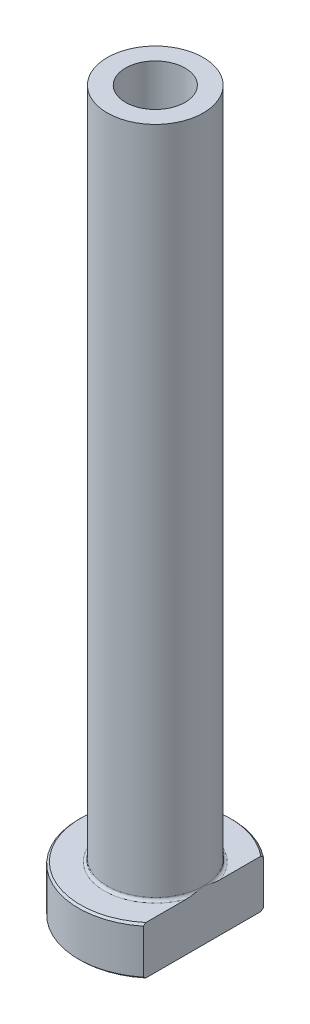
ISO-10303-21;
HEADER;
FILE_DESCRIPTION(('STEP AP214'),'2;1');
FILE_NAME('part.step','',(''),(''),'','','');
FILE_SCHEMA(('AUTOMOTIVE_DESIGN { 1 0 10303 214 1 1 1 1 }'));
ENDSEC;
DATA;
#1=APPLICATION_CONTEXT('core data for automotive mechanical design processes');
#2=APPLICATION_PROTOCOL_DEFINITION('international standard','automotive_design',2000,#1);
#3=PRODUCT_CONTEXT('',#1,'mechanical');
#4=PRODUCT('Part','Part','',(#3));
#5=PRODUCT_RELATED_PRODUCT_CATEGORY('part','',(#4));
#6=PRODUCT_DEFINITION_FORMATION('','',#4);
#7=PRODUCT_DEFINITION_CONTEXT('part definition',#1,'design');
#8=PRODUCT_DEFINITION('design','',#6,#7);
#9=PRODUCT_DEFINITION_SHAPE('','',#8);
#10=(LENGTH_UNIT() NAMED_UNIT(*) SI_UNIT(.MILLI.,.METRE.));
#11=(NAMED_UNIT(*) PLANE_ANGLE_UNIT() SI_UNIT($,.RADIAN.));
#12=(NAMED_UNIT(*) SI_UNIT($,.STERADIAN.) SOLID_ANGLE_UNIT());
#13=UNCERTAINTY_MEASURE_WITH_UNIT(LENGTH_MEASURE(1.E-05),#10,'distance_accuracy_value','');
#14=(GEOMETRIC_REPRESENTATION_CONTEXT(3) GLOBAL_UNCERTAINTY_ASSIGNED_CONTEXT((#13)) GLOBAL_UNIT_ASSIGNED_CONTEXT((#10,
#11,#12)) REPRESENTATION_CONTEXT('',''));
#15=CARTESIAN_POINT('',(0.,0.,0.));
#16=DIRECTION('',(0.,0.,1.));
#17=DIRECTION('',(1.,0.,0.));
#18=AXIS2_PLACEMENT_3D('',#15,#16,#17);
#19=CARTESIAN_POINT('',(0.,92.1876809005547,0.));
#20=DIRECTION('',(0.,1.,0.));
#21=DIRECTION('',(0.,0.,1.));
#22=AXIS2_PLACEMENT_3D('',#19,#20,#21);
#23=CYLINDRICAL_SURFACE('',#22,3.10000000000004);
#24=CARTESIAN_POINT('',(0.,75.,0.));
#25=DIRECTION('',(0.,1.,0.));
#26=DIRECTION('',(0.,0.,1.));
#27=AXIS2_PLACEMENT_3D('',#24,#25,#26);
#28=CIRCLE('',#27,3.10000000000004);
#29=CARTESIAN_POINT('',(0.,75.,3.10000000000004));
#30=VERTEX_POINT('',#29);
#31=EDGE_CURVE('E167',#30,#30,#28,.T.);
#32=ORIENTED_EDGE('',*,*,#31,.T.);
#33=EDGE_LOOP('',(#32));
#34=FACE_BOUND('',#33,.T.);
#35=CARTESIAN_POINT('',(0.,30.,0.));
#36=DIRECTION('',(0.,1.,0.));
#37=DIRECTION('',(0.,0.,1.));
#38=AXIS2_PLACEMENT_3D('',#35,#36,#37);
#39=CIRCLE('',#38,3.10000000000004);
#40=CARTESIAN_POINT('',(0.,30.,3.10000000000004));
#41=VERTEX_POINT('',#40);
#42=EDGE_CURVE('E170',#41,#41,#39,.T.);
#43=ORIENTED_EDGE('',*,*,#42,.F.);
#44=EDGE_LOOP('',(#43));
#45=FACE_BOUND('',#44,.T.);
#46=ADVANCED_FACE('F32',(#34,#45),#23,.F.);
#47=CARTESIAN_POINT('',(-3.10000000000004,75.,0.));
#48=DIRECTION('',(0.,1.,0.));
#49=DIRECTION('',(0.,0.,1.));
#50=AXIS2_PLACEMENT_3D('',#47,#48,#49);
#51=PLANE('',#50);
#52=CARTESIAN_POINT('',(0.,75.,0.));
#53=DIRECTION('',(0.,1.,0.));
#54=DIRECTION('',(0.,0.,1.));
#55=AXIS2_PLACEMENT_3D('',#52,#53,#54);
#56=CIRCLE('',#55,5.);
#57=CARTESIAN_POINT('',(0.,75.,5.));
#58=VERTEX_POINT('',#57);
#59=EDGE_CURVE('E174',#58,#58,#56,.T.);
#60=ORIENTED_EDGE('',*,*,#59,.T.);
#61=EDGE_LOOP('',(#60));
#62=FACE_BOUND('',#61,.T.);
#63=ORIENTED_EDGE('',*,*,#31,.F.);
#64=EDGE_LOOP('',(#63));
#65=FACE_BOUND('',#64,.T.);
#66=ADVANCED_FACE('F157',(#62,#65),#51,.T.);
#67=CARTESIAN_POINT('',(0.,92.1876809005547,0.));
#68=DIRECTION('',(0.,1.,0.));
#69=DIRECTION('',(0.,0.,1.));
#70=AXIS2_PLACEMENT_3D('',#67,#68,#69);
#71=CYLINDRICAL_SURFACE('',#70,4.99999999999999);
#72=CARTESIAN_POINT('',(0.,5.3,0.));
#73=DIRECTION('',(0.,1.,0.));
#74=DIRECTION('',(0.,0.,1.));
#75=AXIS2_PLACEMENT_3D('',#72,#73,#74);
#76=CIRCLE('',#75,4.99999999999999);
#77=CARTESIAN_POINT('',(4.99999999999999,5.3,0.));
#78=VERTEX_POINT('',#77);
#79=EDGE_CURVE('E180',#78,#78,#76,.T.);
#80=ORIENTED_EDGE('',*,*,#79,.T.);
#81=EDGE_LOOP('',(#80));
#82=FACE_BOUND('',#81,.T.);
#83=ORIENTED_EDGE('',*,*,#59,.F.);
#84=EDGE_LOOP('',(#83));
#85=FACE_BOUND('',#84,.T.);
#86=ADVANCED_FACE('F162',(#82,#85),#71,.T.);
#87=CARTESIAN_POINT('',(-4.99999999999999,5.,0.));
#88=DIRECTION('',(0.,1.,0.));
#89=DIRECTION('',(0.,0.,1.));
#90=AXIS2_PLACEMENT_3D('',#87,#88,#89);
#91=PLANE('',#90);
#92=DIRECTION('',(0.,0.,1.));
#93=VECTOR('',#92,1.);
#94=CARTESIAN_POINT('',(5.,5.,0.));
#95=LINE('',#94,#93);
#96=CARTESIAN_POINT('',(5.,5.,-5.98665181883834));
#97=VERTEX_POINT('',#96);
#98=CARTESIAN_POINT('',(5.,5.,-1.75783958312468));
#99=VERTEX_POINT('',#98);
#100=EDGE_CURVE('E54',#97,#99,#95,.T.);
#101=ORIENTED_EDGE('',*,*,#100,.F.);
#102=CARTESIAN_POINT('',(0.,5.,0.));
#103=DIRECTION('',(0.,1.,0.));
#104=DIRECTION('',(0.,0.,1.));
#105=AXIS2_PLACEMENT_3D('',#102,#103,#104);
#106=CIRCLE('',#105,7.80000000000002);
#107=CARTESIAN_POINT('',(4.99999999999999,5.,5.98665181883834));
#108=VERTEX_POINT('',#107);
#109=EDGE_CURVE('E186',#97,#108,#106,.T.);
#110=ORIENTED_EDGE('',*,*,#109,.T.);
#111=CARTESIAN_POINT('',(5.,5.,1.75783958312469));
#112=VERTEX_POINT('',#111);
#113=EDGE_CURVE('E134',#112,#108,#95,.T.);
#114=ORIENTED_EDGE('',*,*,#113,.F.);
#115=CARTESIAN_POINT('',(0.,5.,0.));
#116=DIRECTION('',(0.,1.,0.));
#117=DIRECTION('',(0.,0.,1.));
#118=AXIS2_PLACEMENT_3D('',#115,#116,#117);
#119=CIRCLE('',#118,5.29999999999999);
#120=EDGE_CURVE('E183',#112,#99,#119,.F.);
#121=ORIENTED_EDGE('',*,*,#120,.T.);
#122=EDGE_LOOP('',(#101,#110,#114,#121));
#123=FACE_BOUND('',#122,.T.);
#124=ADVANCED_FACE('F197',(#123),#91,.T.);
#125=CARTESIAN_POINT('',(0.,92.1876809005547,0.));
#126=DIRECTION('',(0.,1.,0.));
#127=DIRECTION('',(0.,0.,1.));
#128=AXIS2_PLACEMENT_3D('',#125,#126,#127);
#129=CYLINDRICAL_SURFACE('',#128,7.99999999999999);
#130=DIRECTION('',(0.,-1.,0.));
#131=VECTOR('',#130,1.);
#132=CARTESIAN_POINT('',(4.99999999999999,75.,6.24499799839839));
#133=LINE('',#132,#131);
#134=CARTESIAN_POINT('',(4.99999999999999,4.80000000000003,6.24499799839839));
#135=VERTEX_POINT('',#134);
#136=CARTESIAN_POINT('',(4.99999999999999,0.199999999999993,6.24499799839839));
#137=VERTEX_POINT('',#136);
#138=EDGE_CURVE('E82',#135,#137,#133,.T.);
#139=ORIENTED_EDGE('',*,*,#138,.F.);
#140=CARTESIAN_POINT('',(0.,4.80000000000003,0.));
#141=DIRECTION('',(0.,1.,0.));
#142=DIRECTION('',(0.,0.,1.));
#143=AXIS2_PLACEMENT_3D('',#140,#141,#142);
#144=CIRCLE('',#143,7.99999999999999);
#145=CARTESIAN_POINT('',(5.,4.80000000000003,-6.24499799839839));
#146=VERTEX_POINT('',#145);
#147=EDGE_CURVE('E95',#135,#146,#144,.F.);
#148=ORIENTED_EDGE('',*,*,#147,.T.);
#149=DIRECTION('',(0.,-1.,0.));
#150=VECTOR('',#149,1.);
#151=CARTESIAN_POINT('',(5.,75.,-6.24499799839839));
#152=LINE('',#151,#150);
#153=CARTESIAN_POINT('',(5.,0.199999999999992,-6.24499799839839));
#154=VERTEX_POINT('',#153);
#155=EDGE_CURVE('E192',#146,#154,#152,.T.);
#156=ORIENTED_EDGE('',*,*,#155,.T.);
#157=CARTESIAN_POINT('',(0.,0.199999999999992,0.));
#158=DIRECTION('',(0.,-1.,0.));
#159=DIRECTION('',(0.,0.,-1.));
#160=AXIS2_PLACEMENT_3D('',#157,#158,#159);
#161=CIRCLE('',#160,7.99999999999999);
#162=EDGE_CURVE('E98',#154,#137,#161,.F.);
#163=ORIENTED_EDGE('',*,*,#162,.T.);
#164=EDGE_LOOP('',(#139,#148,#156,#163));
#165=FACE_BOUND('',#164,.T.);
#166=ADVANCED_FACE('F190',(#165),#129,.T.);
#167=CARTESIAN_POINT('',(-7.99999999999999,0.,0.));
#168=DIRECTION('',(0.,-1.,0.));
#169=DIRECTION('',(0.,0.,-1.));
#170=AXIS2_PLACEMENT_3D('',#167,#168,#169);
#171=PLANE('',#170);
#172=CARTESIAN_POINT('',(0.,0.,0.));
#173=DIRECTION('',(0.,-1.,0.));
#174=DIRECTION('',(0.,0.,-1.));
#175=AXIS2_PLACEMENT_3D('',#172,#173,#174);
#176=CIRCLE('',#175,3.84999999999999);
#177=CARTESIAN_POINT('',(0.,0.,-3.84999999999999));
#178=VERTEX_POINT('',#177);
#179=EDGE_CURVE('E40',#178,#178,#176,.F.);
#180=ORIENTED_EDGE('',*,*,#179,.T.);
#181=EDGE_LOOP('',(#180));
#182=FACE_BOUND('',#181,.T.);
#183=DIRECTION('',(0.,0.,-1.));
#184=VECTOR('',#183,1.);
#185=CARTESIAN_POINT('',(4.99999999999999,0.,6.24499799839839));
#186=LINE('',#185,#184);
#187=CARTESIAN_POINT('',(4.99999999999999,0.,5.98665181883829));
#188=VERTEX_POINT('',#187);
#189=CARTESIAN_POINT('',(5.,0.,-5.98665181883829));
#190=VERTEX_POINT('',#189);
#191=EDGE_CURVE('E47',#188,#190,#186,.T.);
#192=ORIENTED_EDGE('',*,*,#191,.F.);
#193=CARTESIAN_POINT('',(0.,0.,0.));
#194=DIRECTION('',(0.,-1.,0.));
#195=DIRECTION('',(0.,0.,-1.));
#196=AXIS2_PLACEMENT_3D('',#193,#194,#195);
#197=CIRCLE('',#196,7.79999999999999);
#198=EDGE_CURVE('E92',#188,#190,#197,.T.);
#199=ORIENTED_EDGE('',*,*,#198,.T.);
#200=EDGE_LOOP('',(#192,#199));
#201=FACE_BOUND('',#200,.T.);
#202=ADVANCED_FACE('F91',(#182,#201),#171,.T.);
#203=CARTESIAN_POINT('',(0.,92.1876809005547,0.));
#204=DIRECTION('',(0.,1.,0.));
#205=DIRECTION('',(0.,0.,1.));
#206=AXIS2_PLACEMENT_3D('',#203,#204,#205);
#207=CYLINDRICAL_SURFACE('',#206,3.34999999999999);
#208=CARTESIAN_POINT('',(0.,0.5,0.));
#209=DIRECTION('',(0.,-1.,0.));
#210=DIRECTION('',(0.,0.,-1.));
#211=AXIS2_PLACEMENT_3D('',#208,#209,#210);
#212=CIRCLE('',#211,3.34999999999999);
#213=CARTESIAN_POINT('',(0.,0.5,-3.34999999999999));
#214=VERTEX_POINT('',#213);
#215=EDGE_CURVE('E11',#214,#214,#212,.T.);
#216=ORIENTED_EDGE('',*,*,#215,.T.);
#217=EDGE_LOOP('',(#216));
#218=FACE_BOUND('',#217,.T.);
#219=CARTESIAN_POINT('',(0.,18.,0.));
#220=DIRECTION('',(0.,1.,0.));
#221=DIRECTION('',(0.,0.,1.));
#222=AXIS2_PLACEMENT_3D('',#219,#220,#221);
#223=CIRCLE('',#222,3.34999999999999);
#224=CARTESIAN_POINT('',(0.,18.,3.34999999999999));
#225=VERTEX_POINT('',#224);
#226=EDGE_CURVE('E172',#225,#225,#223,.T.);
#227=ORIENTED_EDGE('',*,*,#226,.T.);
#228=EDGE_LOOP('',(#227));
#229=FACE_BOUND('',#228,.T.);
#230=ADVANCED_FACE('F215',(#218,#229),#207,.F.);
#231=CARTESIAN_POINT('',(0.,18.,0.));
#232=DIRECTION('',(0.,-1.,0.));
#233=DIRECTION('',(0.,0.,-1.));
#234=AXIS2_PLACEMENT_3D('',#231,#232,#233);
#235=CONICAL_SURFACE('',#234,3.34999999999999,0.0208303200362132);
#236=ORIENTED_EDGE('',*,*,#42,.T.);
#237=EDGE_LOOP('',(#236));
#238=FACE_BOUND('',#237,.T.);
#239=ORIENTED_EDGE('',*,*,#226,.F.);
#240=EDGE_LOOP('',(#239));
#241=FACE_BOUND('',#240,.T.);
#242=ADVANCED_FACE('F111',(#238,#241),#235,.F.);
#243=CARTESIAN_POINT('',(0.,5.3,0.));
#244=DIRECTION('',(0.,1.,0.));
#245=DIRECTION('',(0.,0.,1.));
#246=AXIS2_PLACEMENT_3D('',#243,#244,#245);
#247=TOROIDAL_SURFACE('',#246,5.29999999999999,0.3);
#248=ORIENTED_EDGE('',*,*,#120,.F.);
#249=CARTESIAN_POINT('',(4.99999999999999,5.3,0.));
#250=CARTESIAN_POINT('',(4.99999999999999,5.30000062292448,-1.31469232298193E-10));
#251=CARTESIAN_POINT('',(5.,5.30000124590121,2.52759193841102E-07));
#252=CARTESIAN_POINT('',(5.,5.30000240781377,9.47164293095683E-07));
#253=CARTESIAN_POINT('',(5.,5.30000293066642,1.4059403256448E-06));
#254=CARTESIAN_POINT('',(5.,5.30000402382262,2.50637598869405E-06));
#255=CARTESIAN_POINT('',(5.,5.3000045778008,3.16588898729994E-06));
#256=CARTESIAN_POINT('',(5.,5.3000055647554,4.52859954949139E-06));
#257=CARTESIAN_POINT('',(5.,5.30000600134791,5.22939438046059E-06));
#258=CARTESIAN_POINT('',(5.,5.30000763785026,7.96121967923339E-06));
#259=CARTESIAN_POINT('',(5.,5.30000875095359,1.00477407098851E-05));
#260=CARTESIAN_POINT('',(5.,5.30001056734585,1.41660871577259E-05));
#261=CARTESIAN_POINT('',(5.,5.30001129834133,1.61861781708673E-05));
#262=CARTESIAN_POINT('',(5.,5.30001439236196,2.47865737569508E-05));
#263=CARTESIAN_POINT('',(5.,5.30001672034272,3.13830278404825E-05));
#264=CARTESIAN_POINT('',(5.,5.30002012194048,4.38084214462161E-05));
#265=CARTESIAN_POINT('',(5.,5.30002133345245,4.95992733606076E-05));
#266=CARTESIAN_POINT('',(5.,5.30003020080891,9.27862605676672E-05));
#267=CARTESIAN_POINT('',(5.,5.30003696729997,0.000130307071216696));
#268=CARTESIAN_POINT('',(5.,5.30006659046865,0.000278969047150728));
#269=CARTESIAN_POINT('',(5.,5.30009481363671,0.000389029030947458));
#270=CARTESIAN_POINT('',(5.,5.30020506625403,0.000826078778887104));
#271=CARTESIAN_POINT('',(5.,5.30028365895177,0.00115365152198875));
#272=CARTESIAN_POINT('',(5.,5.30059919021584,0.00245925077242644));
#273=CARTESIAN_POINT('',(5.,5.3008404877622,0.00343651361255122));
#274=CARTESIAN_POINT('',(5.,5.3018462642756,0.00752058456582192));
#275=CARTESIAN_POINT('',(5.,5.3026052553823,0.0106283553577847));
#276=CARTESIAN_POINT('',(5.,5.30996461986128,0.0407482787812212));
#277=CARTESIAN_POINT('',(5.,5.31658985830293,0.0677561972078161));
#278=CARTESIAN_POINT('',(5.,5.32953319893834,0.120688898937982));
#279=CARTESIAN_POINT('',(5.,5.33585289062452,0.146613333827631));
#280=CARTESIAN_POINT('',(5.,5.34926050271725,0.201795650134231));
#281=CARTESIAN_POINT('',(5.,5.35634306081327,0.231054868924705));
#282=CARTESIAN_POINT('',(5.,5.37050252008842,0.28991773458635));
#283=CARTESIAN_POINT('',(5.,5.37757848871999,0.319521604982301));
#284=CARTESIAN_POINT('',(5.,5.39452602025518,0.39103205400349));
#285=CARTESIAN_POINT('',(5.,5.40434071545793,0.4329521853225));
#286=CARTESIAN_POINT('',(5.,5.42340141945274,0.515763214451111));
#287=CARTESIAN_POINT('',(5.,5.43265559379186,0.556652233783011));
#288=CARTESIAN_POINT('',(5.,5.45710553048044,0.667075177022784));
#289=CARTESIAN_POINT('',(5.,5.47194176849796,0.736689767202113));
#290=CARTESIAN_POINT('',(5.,5.50018229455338,0.876836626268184));
#291=CARTESIAN_POINT('',(5.,5.51357312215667,0.947371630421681));
#292=CARTESIAN_POINT('',(5.,5.53930921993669,1.09497328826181));
#293=CARTESIAN_POINT('',(5.,5.55146217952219,1.17207432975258));
#294=CARTESIAN_POINT('',(5.,5.5723966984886,1.32672649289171));
#295=CARTESIAN_POINT('',(5.,5.58117877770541,1.40427754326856));
#296=CARTESIAN_POINT('',(5.,5.59499725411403,1.56873827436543));
#297=CARTESIAN_POINT('',(5.,5.59948802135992,1.65570044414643));
#298=CARTESIAN_POINT('',(5.,5.60018885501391,1.78535304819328));
#299=CARTESIAN_POINT('',(5.,5.59945214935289,1.82802575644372));
#300=CARTESIAN_POINT('',(5.,5.59559364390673,1.91325081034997));
#301=CARTESIAN_POINT('',(5.,5.59247319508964,1.95580321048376));
#302=CARTESIAN_POINT('',(5.,5.58383242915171,2.03512365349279));
#303=CARTESIAN_POINT('',(5.,5.57867386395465,2.07192937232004));
#304=CARTESIAN_POINT('',(5.,5.56543793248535,2.14526756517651));
#305=CARTESIAN_POINT('',(5.,5.55734203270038,2.18179676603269));
#306=CARTESIAN_POINT('',(5.,5.53718005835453,2.25427226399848));
#307=CARTESIAN_POINT('',(5.,5.52507057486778,2.29020746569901));
#308=CARTESIAN_POINT('',(5.,5.5027092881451,2.3422302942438));
#309=CARTESIAN_POINT('',(5.,5.49457811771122,2.3592231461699));
#310=CARTESIAN_POINT('',(5.,5.47657809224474,2.39224900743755));
#311=CARTESIAN_POINT('',(5.,5.4667128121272,2.40828390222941));
#312=CARTESIAN_POINT('',(5.,5.44695893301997,2.43579467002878));
#313=CARTESIAN_POINT('',(5.,5.43745879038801,2.4475459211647));
#314=CARTESIAN_POINT('',(5.,5.41677914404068,2.46946476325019));
#315=CARTESIAN_POINT('',(5.,5.4056054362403,2.47963758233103));
#316=CARTESIAN_POINT('',(5.,5.38617750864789,2.49393642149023));
#317=CARTESIAN_POINT('',(5.,5.37851643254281,2.49886271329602));
#318=CARTESIAN_POINT('',(5.,5.3625274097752,2.50749953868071));
#319=CARTESIAN_POINT('',(5.,5.35419984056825,2.51121075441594));
#320=CARTESIAN_POINT('',(5.,5.33690648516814,2.51712941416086));
#321=CARTESIAN_POINT('',(5.,5.32793451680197,2.51931927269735));
#322=CARTESIAN_POINT('',(5.,5.30973576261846,2.52185978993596));
#323=CARTESIAN_POINT('',(5.,5.30050931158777,2.52221275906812));
#324=CARTESIAN_POINT('',(5.,5.28349166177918,2.52112455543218));
#325=CARTESIAN_POINT('',(5.,5.27568322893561,2.51993178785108));
#326=CARTESIAN_POINT('',(5.,5.26036860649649,2.51628294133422));
#327=CARTESIAN_POINT('',(5.,5.25286261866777,2.51382603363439));
#328=CARTESIAN_POINT('',(5.,5.23590266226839,2.50685484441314));
#329=CARTESIAN_POINT('',(5.,5.22661875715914,2.5019298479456));
#330=CARTESIAN_POINT('',(5.,5.20895514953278,2.49066548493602));
#331=CARTESIAN_POINT('',(5.,5.2005775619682,2.48432291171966));
#332=CARTESIAN_POINT('',(5.,5.17987008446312,2.46645212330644));
#333=CARTESIAN_POINT('',(5.,5.16824151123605,2.45411867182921));
#334=CARTESIAN_POINT('',(5.,5.14692461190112,2.42790849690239));
#335=CARTESIAN_POINT('',(5.,5.13723987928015,2.41402898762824));
#336=CARTESIAN_POINT('',(5.,5.11080706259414,2.37143175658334));
#337=CARTESIAN_POINT('',(5.,5.09628770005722,2.3413470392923));
#338=CARTESIAN_POINT('',(5.,5.0713034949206,2.27940731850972));
#339=CARTESIAN_POINT('',(5.,5.06087110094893,2.24754035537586));
#340=CARTESIAN_POINT('',(5.,5.03890359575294,2.16787245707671));
#341=CARTESIAN_POINT('',(5.,5.02913523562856,2.11959065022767));
#342=CARTESIAN_POINT('',(5.,5.0141695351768,2.02224928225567));
#343=CARTESIAN_POINT('',(5.,5.00898637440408,1.97318778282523));
#344=CARTESIAN_POINT('',(5.,5.00220823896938,1.87635767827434));
#345=CARTESIAN_POINT('',(5.,5.00050709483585,1.82859609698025));
#346=CARTESIAN_POINT('',(5.,4.9996910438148,1.73330165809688));
#347=CARTESIAN_POINT('',(5.,5.00056327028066,1.68576884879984));
#348=CARTESIAN_POINT('',(5.,5.00484296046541,1.57937770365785));
#349=CARTESIAN_POINT('',(5.,5.00880932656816,1.52054285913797));
#350=CARTESIAN_POINT('',(5.,5.0192596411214,1.40312974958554));
#351=CARTESIAN_POINT('',(5.,5.0257426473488,1.34455139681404));
#352=CARTESIAN_POINT('',(5.,5.04090087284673,1.22627662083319));
#353=CARTESIAN_POINT('',(5.,5.04962425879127,1.1665864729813));
#354=CARTESIAN_POINT('',(5.,5.06877923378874,1.04732463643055));
#355=CARTESIAN_POINT('',(5.,5.07921523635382,0.987753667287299));
#356=CARTESIAN_POINT('',(5.,5.1055169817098,0.846936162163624));
#357=CARTESIAN_POINT('',(5.,5.12196565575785,0.765799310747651));
#358=CARTESIAN_POINT('',(5.,5.1563971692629,0.604819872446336));
#359=CARTESIAN_POINT('',(4.99999999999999,5.17436050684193,0.524973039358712));
#360=CARTESIAN_POINT('',(5.,5.20921667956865,0.374726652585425));
#361=CARTESIAN_POINT('',(5.,5.22599388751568,0.304300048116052));
#362=CARTESIAN_POINT('',(4.99999999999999,5.25191105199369,0.196907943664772));
#363=CARTESIAN_POINT('',(4.99999999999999,5.26090146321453,0.159905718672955));
#364=CARTESIAN_POINT('',(5.,5.27881854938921,0.0865164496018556));
#365=CARTESIAN_POINT('',(5.00000000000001,5.2877439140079,0.050129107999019));
#366=CARTESIAN_POINT('',(4.99999999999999,5.29739627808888,0.0106218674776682));
#367=CARTESIAN_POINT('',(4.99999999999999,5.29815688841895,0.00750762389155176));
#368=CARTESIAN_POINT('',(5.,5.29916304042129,0.00342209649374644));
#369=CARTESIAN_POINT('',(5.,5.29940309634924,0.00244985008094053));
#370=CARTESIAN_POINT('',(4.99999999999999,5.29971711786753,0.00115049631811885));
#371=CARTESIAN_POINT('',(4.99999999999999,5.29979541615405,0.00082414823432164));
#372=CARTESIAN_POINT('',(5.,5.29990531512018,0.00038852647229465));
#373=CARTESIAN_POINT('',(5.,5.29993348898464,0.000278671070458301));
#374=CARTESIAN_POINT('',(4.99999999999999,5.29996306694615,0.000130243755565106));
#375=CARTESIAN_POINT('',(4.99999999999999,5.29996982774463,9.27511370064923E-05));
#376=CARTESIAN_POINT('',(5.,5.29997868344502,4.95929883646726E-05));
#377=CARTESIAN_POINT('',(5.,5.29997989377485,4.38036549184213E-05));
#378=CARTESIAN_POINT('',(4.99999999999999,5.29998329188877,3.13814180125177E-05));
#379=CARTESIAN_POINT('',(4.99999999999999,5.29998561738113,2.47865216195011E-05));
#380=CARTESIAN_POINT('',(5.,5.29998870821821,1.61877545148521E-05));
#381=CARTESIAN_POINT('',(5.,5.29998943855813,1.41677766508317E-05));
#382=CARTESIAN_POINT('',(5.,5.29999125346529,1.00495528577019E-05));
#383=CARTESIAN_POINT('',(5.,5.2999923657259,7.96302642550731E-06));
#384=CARTESIAN_POINT('',(5.,5.29999400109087,5.23107408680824E-06));
#385=CARTESIAN_POINT('',(5.,5.2999944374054,4.53021024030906E-06));
#386=CARTESIAN_POINT('',(5.,5.29999542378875,3.16731146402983E-06));
#387=CARTESIAN_POINT('',(5.,5.2999959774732,2.50767719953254E-06));
#388=CARTESIAN_POINT('',(5.,5.2999970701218,1.40695874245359E-06));
#389=CARTESIAN_POINT('',(5.,5.29999759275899,9.48032399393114E-07));
#390=CARTESIAN_POINT('',(5.,5.29999875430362,2.53244302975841E-07));
#391=CARTESIAN_POINT('',(4.99999999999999,5.29999937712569,1.31460034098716E-10));
#392=CARTESIAN_POINT('',(4.99999999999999,5.3,0.));
#393=B_SPLINE_CURVE_WITH_KNOTS('',3,(#249,#250,#251,#252,#253,#254,#255,#256,#257,#258,#259,
#260,#261,#262,#263,#264,#265,#266,#267,#268,#269,#270,#271,#272,#273,#274,#275,#276,#277,#278,
#279,#280,#281,#282,#283,#284,#285,#286,#287,#288,#289,#290,#291,#292,#293,#294,#295,#296,#297,
#298,#299,#300,#301,#302,#303,#304,#305,#306,#307,#308,#309,#310,#311,#312,#313,#314,#315,#316,
#317,#318,#319,#320,#321,#322,#323,#324,#325,#326,#327,#328,#329,#330,#331,#332,#333,#334,#335,
#336,#337,#338,#339,#340,#341,#342,#343,#344,#345,#346,#347,#348,#349,#350,#351,#352,#353,#354,
#355,#356,#357,#358,#359,#360,#361,#362,#363,#364,#365,#366,#367,#368,#369,#370,#371,#372,#373,
#374,#375,#376,#377,#378,#379,#380,#381,#382,#383,#384,#385,#386,#387,#388,#389,#390,#391,#392),
.UNSPECIFIED.,.T.,.F.,(4,2,2,2,2,2,2,2,2,2,2,2,2,2,2,2,2,2,2,2,2,2,2,2,2,2,2,2,2,2,2,2,2,2,2,2,
2,2,2,2,2,2,2,2,2,2,2,2,2,2,2,2,2,2,2,2,2,2,2,2,2,2,2,2,2,2,2,2,2,2,2,4),(0.,
1.88939336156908E-06,3.98058950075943E-06,6.54818606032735E-06,9.02404445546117E-06,
1.60938756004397E-05,2.25328205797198E-05,4.34843928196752E-05,6.12120208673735E-05,
0.00017562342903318,0.000516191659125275,0.00152710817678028,0.00454656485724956,
0.0141443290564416,0.0975679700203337,0.177619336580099,0.267931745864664,0.359245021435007,
0.488405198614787,0.61417378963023,0.827694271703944,1.04305715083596,1.2771560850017,
1.51121890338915,1.77214751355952,1.90013509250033,2.02805018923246,2.13945459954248,
2.25157451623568,2.36494894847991,2.4213923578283,2.47772074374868,2.52293802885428,
2.56800219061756,2.59524342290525,2.62246933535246,2.65000494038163,2.67750590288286,
2.70108948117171,2.72468854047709,2.75603978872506,2.78746268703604,2.83802806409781,
2.88868607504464,2.98834295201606,3.08877575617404,3.23618650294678,3.38405153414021,
3.52733651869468,3.66990630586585,3.84673903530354,4.02350562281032,4.20444776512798,
4.38586374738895,4.63419556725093,4.87971270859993,5.09690175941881,5.21113882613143,
5.32353360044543,5.33315137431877,5.33615533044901,5.33716246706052,5.33750240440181,
5.33761672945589,5.33763445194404,5.33765539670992,5.33766183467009,5.33766890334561,
5.33767137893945,5.33767394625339,5.33767603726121,5.33767792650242),.UNSPECIFIED.);
#394=EDGE_CURVE('E126',#112,#78,#393,.T.);
#395=ORIENTED_EDGE('',*,*,#394,.T.);
#396=ORIENTED_EDGE('',*,*,#79,.F.);
#397=CARTESIAN_POINT('',(4.99999999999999,5.3,0.));
#398=CARTESIAN_POINT('',(4.99999999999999,5.29999937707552,1.31470358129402E-10));
#399=CARTESIAN_POINT('',(5.,5.29999875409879,-2.52759192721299E-07));
#400=CARTESIAN_POINT('',(5.,5.29999759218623,-9.47164291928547E-07));
#401=CARTESIAN_POINT('',(5.,5.29999706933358,-1.40594032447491E-06));
#402=CARTESIAN_POINT('',(5.,5.29999597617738,-2.50637598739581E-06));
#403=CARTESIAN_POINT('',(5.,5.29999542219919,-3.16588898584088E-06));
#404=CARTESIAN_POINT('',(5.,5.2999944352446,-4.52859954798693E-06));
#405=CARTESIAN_POINT('',(5.,5.29999399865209,-5.22939437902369E-06));
#406=CARTESIAN_POINT('',(5.,5.29999236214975,-7.96121967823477E-06));
#407=CARTESIAN_POINT('',(5.,5.2999912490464,-1.00477407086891E-05));
#408=CARTESIAN_POINT('',(5.,5.29998943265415,-1.41660871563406E-05));
#409=CARTESIAN_POINT('',(5.,5.29998870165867,-1.61861781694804E-05));
#410=CARTESIAN_POINT('',(5.,5.29998560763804,-2.47865737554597E-05));
#411=CARTESIAN_POINT('',(5.,5.29998327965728,-3.13830278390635E-05));
#412=CARTESIAN_POINT('',(5.,5.29997987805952,-4.38084214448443E-05));
#413=CARTESIAN_POINT('',(5.,5.29997866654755,-4.95992733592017E-05));
#414=CARTESIAN_POINT('',(5.,5.29996979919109,-9.27862605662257E-05));
#415=CARTESIAN_POINT('',(5.,5.29996303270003,-0.000130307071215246));
#416=CARTESIAN_POINT('',(5.,5.29993340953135,-0.000278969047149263));
#417=CARTESIAN_POINT('',(5.,5.29990518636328,-0.000389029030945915));
#418=CARTESIAN_POINT('',(5.,5.29979493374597,-0.000826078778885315));
#419=CARTESIAN_POINT('',(5.,5.29971634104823,-0.00115365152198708));
#420=CARTESIAN_POINT('',(5.,5.29940080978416,-0.00245925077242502));
#421=CARTESIAN_POINT('',(5.,5.2991595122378,-0.00343651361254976));
#422=CARTESIAN_POINT('',(5.,5.2981537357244,-0.00752058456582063));
#423=CARTESIAN_POINT('',(5.,5.2973947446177,-0.0106283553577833));
#424=CARTESIAN_POINT('',(5.,5.29003538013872,-0.0407482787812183));
#425=CARTESIAN_POINT('',(5.,5.28341014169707,-0.0677561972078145));
#426=CARTESIAN_POINT('',(5.,5.27046680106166,-0.120688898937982));
#427=CARTESIAN_POINT('',(5.,5.26414710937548,-0.146613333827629));
#428=CARTESIAN_POINT('',(5.,5.25073949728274,-0.201795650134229));
#429=CARTESIAN_POINT('',(5.,5.24365693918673,-0.231054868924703));
#430=CARTESIAN_POINT('',(5.,5.22949747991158,-0.289917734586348));
#431=CARTESIAN_POINT('',(5.,5.22242151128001,-0.319521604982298));
#432=CARTESIAN_POINT('',(5.,5.20547397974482,-0.391032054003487));
#433=CARTESIAN_POINT('',(5.,5.19565928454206,-0.432952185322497));
#434=CARTESIAN_POINT('',(5.,5.17659858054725,-0.515763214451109));
#435=CARTESIAN_POINT('',(5.,5.16734440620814,-0.556652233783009));
#436=CARTESIAN_POINT('',(5.,5.14289446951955,-0.667075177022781));
#437=CARTESIAN_POINT('',(5.,5.12805823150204,-0.736689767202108));
#438=CARTESIAN_POINT('',(5.,5.09981770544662,-0.876836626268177));
#439=CARTESIAN_POINT('',(5.,5.08642687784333,-0.947371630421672));
#440=CARTESIAN_POINT('',(5.,5.06069078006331,-1.09497328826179));
#441=CARTESIAN_POINT('',(5.,5.04853782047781,-1.17207432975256));
#442=CARTESIAN_POINT('',(5.,5.0276033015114,-1.32672649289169));
#443=CARTESIAN_POINT('',(5.,5.01882122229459,-1.40427754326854));
#444=CARTESIAN_POINT('',(5.,5.00500274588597,-1.56873827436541));
#445=CARTESIAN_POINT('',(5.,5.00051197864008,-1.65570044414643));
#446=CARTESIAN_POINT('',(5.,4.99981114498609,-1.78535304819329));
#447=CARTESIAN_POINT('',(5.,5.00054785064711,-1.82802575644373));
#448=CARTESIAN_POINT('',(5.,5.00440635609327,-1.91325081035));
#449=CARTESIAN_POINT('',(5.,5.00752680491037,-1.9558032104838));
#450=CARTESIAN_POINT('',(5.,5.01616757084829,-2.03512365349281));
#451=CARTESIAN_POINT('',(5.,5.02132613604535,-2.07192937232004));
#452=CARTESIAN_POINT('',(5.,5.03456206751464,-2.14526756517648));
#453=CARTESIAN_POINT('',(5.,5.0426579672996,-2.18179676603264));
#454=CARTESIAN_POINT('',(5.,5.06281994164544,-2.25427226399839));
#455=CARTESIAN_POINT('',(5.,5.07492942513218,-2.2902074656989));
#456=CARTESIAN_POINT('',(5.,5.09729071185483,-2.34223029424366));
#457=CARTESIAN_POINT('',(5.,5.10542188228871,-2.35922314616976));
#458=CARTESIAN_POINT('',(5.,5.12342190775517,-2.3922490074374));
#459=CARTESIAN_POINT('',(5.,5.13328718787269,-2.40828390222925));
#460=CARTESIAN_POINT('',(5.,5.15304106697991,-2.43579467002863));
#461=CARTESIAN_POINT('',(5.,5.16254120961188,-2.44754592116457));
#462=CARTESIAN_POINT('',(5.,5.18322085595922,-2.46946476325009));
#463=CARTESIAN_POINT('',(5.,5.1943945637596,-2.47963758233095));
#464=CARTESIAN_POINT('',(5.,5.21382249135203,-2.49393642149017));
#465=CARTESIAN_POINT('',(5.,5.22148356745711,-2.49886271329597));
#466=CARTESIAN_POINT('',(5.,5.23747259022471,-2.50749953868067));
#467=CARTESIAN_POINT('',(5.,5.24580015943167,-2.5112107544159));
#468=CARTESIAN_POINT('',(5.,5.26309351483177,-2.51712941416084));
#469=CARTESIAN_POINT('',(5.,5.27206548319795,-2.51931927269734));
#470=CARTESIAN_POINT('',(5.,5.29026423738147,-2.52185978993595));
#471=CARTESIAN_POINT('',(5.,5.29949068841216,-2.52221275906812));
#472=CARTESIAN_POINT('',(5.,5.31650833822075,-2.52112455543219));
#473=CARTESIAN_POINT('',(5.,5.32431677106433,-2.51993178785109));
#474=CARTESIAN_POINT('',(5.,5.33963139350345,-2.51628294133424));
#475=CARTESIAN_POINT('',(5.,5.34713738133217,-2.51382603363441));
#476=CARTESIAN_POINT('',(5.,5.36409733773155,-2.50685484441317));
#477=CARTESIAN_POINT('',(5.,5.3733812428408,-2.50192984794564));
#478=CARTESIAN_POINT('',(5.,5.39104485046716,-2.49066548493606));
#479=CARTESIAN_POINT('',(5.,5.39942243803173,-2.48432291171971));
#480=CARTESIAN_POINT('',(5.,5.42012991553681,-2.46645212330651));
#481=CARTESIAN_POINT('',(5.,5.43175848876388,-2.45411867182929));
#482=CARTESIAN_POINT('',(5.,5.4530753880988,-2.42790849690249));
#483=CARTESIAN_POINT('',(5.,5.46276012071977,-2.41402898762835));
#484=CARTESIAN_POINT('',(5.,5.48919293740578,-2.3714317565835));
#485=CARTESIAN_POINT('',(5.,5.50371229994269,-2.34134703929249));
#486=CARTESIAN_POINT('',(5.,5.52869650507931,-2.27940731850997));
#487=CARTESIAN_POINT('',(5.,5.53912889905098,-2.24754035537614));
#488=CARTESIAN_POINT('',(5.,5.56109640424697,-2.16787245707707));
#489=CARTESIAN_POINT('',(5.,5.57086476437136,-2.11959065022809));
#490=CARTESIAN_POINT('',(5.,5.58583046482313,-2.0222492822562));
#491=CARTESIAN_POINT('',(5.,5.59101362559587,-1.97318778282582));
#492=CARTESIAN_POINT('',(5.,5.59779176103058,-1.87635767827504));
#493=CARTESIAN_POINT('',(5.,5.59949290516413,-1.828596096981));
#494=CARTESIAN_POINT('',(5.,5.6003089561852,-1.73330165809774));
#495=CARTESIAN_POINT('',(5.,5.59943672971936,-1.68576884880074));
#496=CARTESIAN_POINT('',(5.,5.59515703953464,-1.57937770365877));
#497=CARTESIAN_POINT('',(5.,5.59119067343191,-1.52054285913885));
#498=CARTESIAN_POINT('',(5.,5.58074035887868,-1.40312974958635));
#499=CARTESIAN_POINT('',(5.,5.57425735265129,-1.34455139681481));
#500=CARTESIAN_POINT('',(5.,5.55909912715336,-1.22627662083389));
#501=CARTESIAN_POINT('',(5.,5.55037574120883,-1.16658647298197));
#502=CARTESIAN_POINT('',(5.,5.53122076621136,-1.04732463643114));
#503=CARTESIAN_POINT('',(5.,5.52078476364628,-0.987753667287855));
#504=CARTESIAN_POINT('',(5.,5.49448301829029,-0.846936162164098));
#505=CARTESIAN_POINT('',(5.,5.47803434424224,-0.765799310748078));
#506=CARTESIAN_POINT('',(5.,5.44360283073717,-0.604819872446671));
#507=CARTESIAN_POINT('',(4.99999999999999,5.42563949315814,-0.524973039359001));
#508=CARTESIAN_POINT('',(5.,5.39078332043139,-0.374726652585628));
#509=CARTESIAN_POINT('',(5.,5.37400611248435,-0.304300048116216));
#510=CARTESIAN_POINT('',(4.99999999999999,5.34808894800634,-0.196907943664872));
#511=CARTESIAN_POINT('',(4.99999999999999,5.3390985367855,-0.159905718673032));
#512=CARTESIAN_POINT('',(5.,5.32118145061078,-0.0865164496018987));
#513=CARTESIAN_POINT('',(5.00000000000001,5.31225608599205,-0.0501291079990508));
#514=CARTESIAN_POINT('',(4.99999999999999,5.30260372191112,-0.0106218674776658));
#515=CARTESIAN_POINT('',(4.99999999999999,5.30184311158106,-0.00750762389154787));
#516=CARTESIAN_POINT('',(5.,5.30083695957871,-0.00342209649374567));
#517=CARTESIAN_POINT('',(5.,5.30059690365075,-0.00244985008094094));
#518=CARTESIAN_POINT('',(4.99999999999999,5.30028288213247,-0.00115049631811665));
#519=CARTESIAN_POINT('',(4.99999999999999,5.30020458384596,-0.000824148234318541));
#520=CARTESIAN_POINT('',(5.,5.30009468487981,-0.000388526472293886));
#521=CARTESIAN_POINT('',(5.,5.30006651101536,-0.000278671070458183));
#522=CARTESIAN_POINT('',(4.99999999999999,5.30003693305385,-0.000130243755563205));
#523=CARTESIAN_POINT('',(4.99999999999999,5.30003017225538,-9.27511370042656E-05));
#524=CARTESIAN_POINT('',(4.99999999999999,5.30002131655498,-4.95929883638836E-05));
#525=CARTESIAN_POINT('',(4.99999999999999,5.30002010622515,-4.38036549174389E-05));
#526=CARTESIAN_POINT('',(4.99999999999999,5.30001670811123,-3.13814180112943E-05));
#527=CARTESIAN_POINT('',(4.99999999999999,5.30001438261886,-2.47865216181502E-05));
#528=CARTESIAN_POINT('',(4.99999999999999,5.30001129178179,-1.61877545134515E-05));
#529=CARTESIAN_POINT('',(4.99999999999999,5.30001056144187,-1.41677766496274E-05));
#530=CARTESIAN_POINT('',(4.99999999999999,5.30000874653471,-1.0049552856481E-05));
#531=CARTESIAN_POINT('',(4.99999999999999,5.30000763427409,-7.96302642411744E-06));
#532=CARTESIAN_POINT('',(4.99999999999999,5.30000599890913,-5.23107408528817E-06));
#533=CARTESIAN_POINT('',(4.99999999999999,5.3000055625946,-4.53021023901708E-06));
#534=CARTESIAN_POINT('',(4.99999999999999,5.30000457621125,-3.16731146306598E-06));
#535=CARTESIAN_POINT('',(4.99999999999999,5.30000402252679,-2.50767719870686E-06));
#536=CARTESIAN_POINT('',(4.99999999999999,5.3000029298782,-1.40695874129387E-06));
#537=CARTESIAN_POINT('',(4.99999999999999,5.30000240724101,-9.48032397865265E-07));
#538=CARTESIAN_POINT('',(4.99999999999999,5.30000124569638,-2.53244301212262E-07));
#539=CARTESIAN_POINT('',(4.99999999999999,5.30000062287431,-1.31458382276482E-10));
#540=CARTESIAN_POINT('',(4.99999999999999,5.3,0.));
#541=B_SPLINE_CURVE_WITH_KNOTS('',3,(#397,#398,#399,#400,#401,#402,#403,#404,#405,#406,#407,
#408,#409,#410,#411,#412,#413,#414,#415,#416,#417,#418,#419,#420,#421,#422,#423,#424,#425,#426,
#427,#428,#429,#430,#431,#432,#433,#434,#435,#436,#437,#438,#439,#440,#441,#442,#443,#444,#445,
#446,#447,#448,#449,#450,#451,#452,#453,#454,#455,#456,#457,#458,#459,#460,#461,#462,#463,#464,
#465,#466,#467,#468,#469,#470,#471,#472,#473,#474,#475,#476,#477,#478,#479,#480,#481,#482,#483,
#484,#485,#486,#487,#488,#489,#490,#491,#492,#493,#494,#495,#496,#497,#498,#499,#500,#501,#502,
#503,#504,#505,#506,#507,#508,#509,#510,#511,#512,#513,#514,#515,#516,#517,#518,#519,#520,#521,
#522,#523,#524,#525,#526,#527,#528,#529,#530,#531,#532,#533,#534,#535,#536,#537,#538,#539,#540),
.UNSPECIFIED.,.T.,.F.,(4,2,2,2,2,2,2,2,2,2,2,2,2,2,2,2,2,2,2,2,2,2,2,2,2,2,2,2,2,2,2,2,2,2,2,2,
2,2,2,2,2,2,2,2,2,2,2,2,2,2,2,2,2,2,2,2,2,2,2,2,2,2,2,2,2,2,2,2,2,2,2,4),(0.,
1.88939336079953E-06,3.98058949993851E-06,6.54818606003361E-06,9.02404445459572E-06,
1.60938755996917E-05,2.25328205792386E-05,4.34843928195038E-05,6.12120208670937E-05,
0.000175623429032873,0.000516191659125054,0.00152710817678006,0.00454656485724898,
0.0141443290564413,0.0975679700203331,0.177619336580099,0.267931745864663,0.359245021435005,
0.488405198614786,0.614173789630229,0.827694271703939,1.04305715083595,1.27715608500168,
1.51121890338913,1.77214751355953,1.90013509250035,2.0280501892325,2.13945459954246,
2.2515745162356,2.36494894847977,2.42139235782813,2.47772074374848,2.52293802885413,
2.56800219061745,2.59524342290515,2.62246933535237,2.65000494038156,2.67750590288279,
2.70108948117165,2.72468854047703,2.75603978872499,2.78746268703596,2.83802806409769,
2.88868607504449,2.98834295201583,3.08877575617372,3.23618650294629,3.38405153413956,
3.52733651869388,3.6699063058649,3.84673903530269,4.02350562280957,4.20444776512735,
4.38586374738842,4.63419556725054,4.87971270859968,5.09690175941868,5.21113882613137,
5.32353360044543,5.33315137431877,5.33615533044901,5.33716246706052,5.33750240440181,
5.33761672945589,5.33763445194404,5.33765539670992,5.33766183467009,5.33766890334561,
5.33767137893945,5.33767394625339,5.33767603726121,5.33767792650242),.UNSPECIFIED.);
#542=EDGE_CURVE('E135',#78,#99,#541,.T.);
#543=ORIENTED_EDGE('',*,*,#542,.T.);
#544=EDGE_LOOP('',(#248,#395,#396,#543));
#545=FACE_BOUND('',#544,.T.);
#546=ADVANCED_FACE('F141',(#545),#247,.F.);
#547=CARTESIAN_POINT('',(0.,5.,0.));
#548=DIRECTION('',(0.,-1.,0.));
#549=DIRECTION('',(0.,0.,-1.));
#550=AXIS2_PLACEMENT_3D('',#547,#548,#549);
#551=CONICAL_SURFACE('',#550,7.80000000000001,0.78539816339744);
#552=CARTESIAN_POINT('',(5.,-1.82162423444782,-13.7401563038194));
#553=CARTESIAN_POINT('',(5.,-1.61889813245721,-13.5244204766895));
#554=CARTESIAN_POINT('',(5.,-1.41646387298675,-13.3084101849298));
#555=CARTESIAN_POINT('',(5.,-1.01227657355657,-12.8757508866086));
#556=CARTESIAN_POINT('',(5.,-0.810523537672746,-12.6591018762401));
#557=CARTESIAN_POINT('',(5.,-0.206157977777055,-12.0077661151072));
#558=CARTESIAN_POINT('',(5.,0.195280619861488,-11.5719884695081));
#559=CARTESIAN_POINT('',(5.,1.00388282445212,-10.6856136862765));
#560=CARTESIAN_POINT('',(5.,1.41093902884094,-10.2349182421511));
#561=CARTESIAN_POINT('',(5.,2.01658324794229,-9.55471676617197));
#562=CARTESIAN_POINT('',(5.,2.21758236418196,-9.32735800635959));
#563=CARTESIAN_POINT('',(5.,2.6176114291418,-8.87091599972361));
#564=CARTESIAN_POINT('',(5.,2.81664139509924,-8.64183276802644));
#565=CARTESIAN_POINT('',(5.,3.21217345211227,-8.18170099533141));
#566=CARTESIAN_POINT('',(5.,3.40867681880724,-7.95065355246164));
#567=CARTESIAN_POINT('',(5.,3.79865427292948,-7.48599989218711));
#568=CARTESIAN_POINT('',(5.,3.99212827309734,-7.25239360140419));
#569=CARTESIAN_POINT('',(5.,4.37558160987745,-6.78155890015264));
#570=CARTESIAN_POINT('',(5.,4.56555334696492,-6.54432428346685));
#571=CARTESIAN_POINT('',(5.,4.94042138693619,-6.06589574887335));
#572=CARTESIAN_POINT('',(5.,5.12531810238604,-5.82470215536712));
#573=CARTESIAN_POINT('',(5.,5.4865354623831,-5.33972956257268));
#574=CARTESIAN_POINT('',(5.,5.66292392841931,-5.09600137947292));
#575=CARTESIAN_POINT('',(5.,6.00675382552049,-4.60213647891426));
#576=CARTESIAN_POINT('',(5.,6.17419169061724,-4.35199726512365));
#577=CARTESIAN_POINT('',(5.,6.49592993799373,-3.84445040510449));
#578=CARTESIAN_POINT('',(5.,6.65027272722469,-3.58707012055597));
#579=CARTESIAN_POINT('',(5.,6.8681341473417,-3.19356592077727));
#580=CARTESIAN_POINT('',(5.,6.93845533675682,-3.06120993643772));
#581=CARTESIAN_POINT('',(5.,7.07360441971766,-2.7937331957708));
#582=CARTESIAN_POINT('',(5.,7.13843319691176,-2.65861288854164));
#583=CARTESIAN_POINT('',(5.,7.26869642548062,-2.36936389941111));
#584=CARTESIAN_POINT('',(5.,7.33331212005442,-2.21486278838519));
#585=CARTESIAN_POINT('',(5.,7.45243473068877,-1.90194073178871));
#586=CARTESIAN_POINT('',(5.,7.50694001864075,-1.74351915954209));
#587=CARTESIAN_POINT('',(5.,7.60343746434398,-1.42384276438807));
#588=CARTESIAN_POINT('',(5.,7.6454991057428,-1.26260921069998));
#589=CARTESIAN_POINT('',(5.,7.71543089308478,-0.937062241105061));
#590=CARTESIAN_POINT('',(5.,7.7433026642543,-0.772749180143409));
#591=CARTESIAN_POINT('',(5.,7.78344284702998,-0.439876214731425));
#592=CARTESIAN_POINT('',(5.,7.79548961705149,-0.271289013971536));
#593=CARTESIAN_POINT('',(5.,7.80240809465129,0.066227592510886));
#594=CARTESIAN_POINT('',(5.,7.79728142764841,0.235156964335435));
#595=CARTESIAN_POINT('',(5.,7.77017954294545,0.572209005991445));
#596=CARTESIAN_POINT('',(5.,7.74814735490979,0.740327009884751));
#597=CARTESIAN_POINT('',(5.,7.68863212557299,1.0737984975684));
#598=CARTESIAN_POINT('',(5.,7.65114437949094,1.23915112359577));
#599=CARTESIAN_POINT('',(5.,7.54734433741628,1.62344926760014));
#600=CARTESIAN_POINT('',(5.,7.47553580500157,1.84089917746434));
#601=CARTESIAN_POINT('',(5.,7.31300119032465,2.26856946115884));
#602=CARTESIAN_POINT('',(5.,7.22226460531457,2.47878574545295));
#603=CARTESIAN_POINT('',(5.,7.07492970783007,2.79014067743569));
#604=CARTESIAN_POINT('',(5.,7.02362278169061,2.89384077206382));
#605=CARTESIAN_POINT('',(5.,6.9178384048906,3.09961626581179));
#606=CARTESIAN_POINT('',(4.99999999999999,6.86336091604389,3.20169164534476));
#607=CARTESIAN_POINT('',(4.99999999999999,6.75169048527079,3.40428995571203));
#608=CARTESIAN_POINT('',(4.99999999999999,6.69449856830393,3.50481345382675));
#609=CARTESIAN_POINT('',(4.99999999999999,6.57774196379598,3.70446206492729));
#610=CARTESIAN_POINT('',(4.99999999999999,6.51817739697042,3.80358724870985));
#611=CARTESIAN_POINT('',(4.99999999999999,6.30853654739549,4.14435766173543));
#612=CARTESIAN_POINT('',(4.99999999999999,6.15326588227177,4.38281352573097));
#613=CARTESIAN_POINT('',(4.99999999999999,5.83377190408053,4.85367607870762));
#614=CARTESIAN_POINT('',(4.99999999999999,5.66954595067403,5.08608095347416));
#615=CARTESIAN_POINT('',(4.99999999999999,5.33431698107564,5.54628554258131));
#616=CARTESIAN_POINT('',(4.99999999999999,5.16330740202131,5.77408045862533));
#617=CARTESIAN_POINT('',(4.99999999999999,4.81629923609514,6.22578157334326));
#618=CARTESIAN_POINT('',(4.99999999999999,4.64030119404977,6.44968819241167));
#619=CARTESIAN_POINT('',(4.99999999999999,4.28368615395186,6.8953257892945));
#620=CARTESIAN_POINT('',(4.99999999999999,4.10305289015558,7.11704371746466));
#621=CARTESIAN_POINT('',(4.99999999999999,3.73870710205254,7.55793799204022));
#622=CARTESIAN_POINT('',(4.99999999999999,3.55499450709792,7.77711427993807));
#623=CARTESIAN_POINT('',(4.99999999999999,3.18521083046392,8.21325328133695));
#624=CARTESIAN_POINT('',(4.99999999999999,2.99914113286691,8.43021717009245));
#625=CARTESIAN_POINT('',(4.99999999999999,2.62499812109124,8.86241167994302));
#626=CARTESIAN_POINT('',(4.99999999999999,2.43692478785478,9.0776422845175));
#627=CARTESIAN_POINT('',(4.99999999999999,1.91463404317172,9.67075518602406));
#628=CARTESIAN_POINT('',(4.99999999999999,1.57868086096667,10.0471086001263));
#629=CARTESIAN_POINT('',(4.99999999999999,0.903003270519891,10.7965122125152));
#630=CARTESIAN_POINT('',(4.99999999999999,0.563278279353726,11.169561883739));
#631=CARTESIAN_POINT('',(4.99999999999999,-0.116149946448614,11.9100168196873));
#632=CARTESIAN_POINT('',(4.99999999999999,-0.455830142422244,12.2774432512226));
#633=CARTESIAN_POINT('',(4.99999999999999,-1.13728640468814,13.0102135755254));
#634=CARTESIAN_POINT('',(4.99999999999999,-1.47906204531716,13.3755578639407));
#635=CARTESIAN_POINT('',(4.99999999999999,-1.82162423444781,13.7401563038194));
#636=B_SPLINE_CURVE_WITH_KNOTS('',3,(#552,#553,#554,#555,#556,#557,#558,#559,#560,#561,#562,
#563,#564,#565,#566,#567,#568,#569,#570,#571,#572,#573,#574,#575,#576,#577,#578,#579,#580,#581,
#582,#583,#584,#585,#586,#587,#588,#589,#590,#591,#592,#593,#594,#595,#596,#597,#598,#599,#600,
#601,#602,#603,#604,#605,#606,#607,#608,#609,#610,#611,#612,#613,#614,#615,#616,#617,#618,#619,
#620,#621,#622,#623,#624,#625,#626,#627,#628,#629,#630,#631,#632,#633,#634,#635),.UNSPECIFIED.,
.F.,.F.,(4,2,2,2,2,2,2,2,2,2,2,2,2,2,2,2,2,2,2,2,2,2,2,2,2,2,2,2,2,2,2,2,2,2,2,2,2,2,2,2,2,4),
(0.,0.888120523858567,1.77624635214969,3.55372511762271,5.3755948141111,6.28598924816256,
7.19637570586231,8.10628289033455,9.016216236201,9.92793449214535,10.8395784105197,
11.7420025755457,12.6447836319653,13.5445196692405,13.9940505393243,14.4435089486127,
14.9456212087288,15.4478142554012,15.947147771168,16.4464240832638,16.952621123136,
17.458770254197,17.966632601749,18.4746496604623,19.160451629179,19.8466351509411,
20.193687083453,20.5407431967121,20.8876692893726,21.234577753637,22.087909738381,
22.9414946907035,23.7959266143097,24.6502655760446,25.5081848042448,26.3661237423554,
27.2235803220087,28.0810450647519,29.5944656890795,31.1081235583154,32.60926785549,
34.1101167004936),.UNSPECIFIED.);
#637=EDGE_CURVE('E133',#146,#97,#636,.T.);
#638=ORIENTED_EDGE('',*,*,#637,.F.);
#639=ORIENTED_EDGE('',*,*,#147,.F.);
#640=EDGE_CURVE('E118',#108,#135,#636,.T.);
#641=ORIENTED_EDGE('',*,*,#640,.F.);
#642=ORIENTED_EDGE('',*,*,#109,.F.);
#643=EDGE_LOOP('',(#638,#639,#641,#642));
#644=FACE_BOUND('',#643,.T.);
#645=ADVANCED_FACE('F145',(#644),#551,.T.);
#646=CARTESIAN_POINT('',(0.,0.199999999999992,0.));
#647=DIRECTION('',(0.,1.,0.));
#648=DIRECTION('',(0.,0.,1.));
#649=AXIS2_PLACEMENT_3D('',#646,#647,#648);
#650=CONICAL_SURFACE('',#649,7.99999999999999,0.785398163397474);
#651=CARTESIAN_POINT('',(4.99999999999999,6.82162423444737,13.7401563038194));
#652=CARTESIAN_POINT('',(4.99999999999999,6.61889813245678,13.5244204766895));
#653=CARTESIAN_POINT('',(4.99999999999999,6.41646387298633,13.3084101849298));
#654=CARTESIAN_POINT('',(4.99999999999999,6.01227657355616,12.8757508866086));
#655=CARTESIAN_POINT('',(4.99999999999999,5.81052353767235,12.65910187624));
#656=CARTESIAN_POINT('',(4.99999999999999,5.20615797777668,12.0077661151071));
#657=CARTESIAN_POINT('',(4.99999999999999,4.80471938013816,11.5719884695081));
#658=CARTESIAN_POINT('',(4.99999999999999,3.99611717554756,10.6856136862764));
#659=CARTESIAN_POINT('',(4.99999999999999,3.58906097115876,10.2349182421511));
#660=CARTESIAN_POINT('',(4.99999999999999,2.98341675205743,9.55471676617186));
#661=CARTESIAN_POINT('',(4.99999999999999,2.78241763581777,9.32735800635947));
#662=CARTESIAN_POINT('',(4.99999999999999,2.38238857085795,8.87091599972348));
#663=CARTESIAN_POINT('',(4.99999999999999,2.18335860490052,8.6418327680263));
#664=CARTESIAN_POINT('',(4.99999999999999,1.7878265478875,8.18170099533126));
#665=CARTESIAN_POINT('',(4.99999999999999,1.59132318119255,7.95065355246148));
#666=CARTESIAN_POINT('',(4.99999999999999,1.20134572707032,7.48599989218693));
#667=CARTESIAN_POINT('',(4.99999999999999,1.00787172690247,7.25239360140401));
#668=CARTESIAN_POINT('',(4.99999999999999,0.624418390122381,6.78155890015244));
#669=CARTESIAN_POINT('',(4.99999999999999,0.43444665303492,6.54432428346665));
#670=CARTESIAN_POINT('',(4.99999999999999,0.0595786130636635,6.06589574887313));
#671=CARTESIAN_POINT('',(4.99999999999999,-0.125318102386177,5.82470215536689));
#672=CARTESIAN_POINT('',(4.99999999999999,-0.486535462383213,5.33972956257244));
#673=CARTESIAN_POINT('',(4.99999999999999,-0.662923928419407,5.09600137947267));
#674=CARTESIAN_POINT('',(4.99999999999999,-1.00675382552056,4.602136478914));
#675=CARTESIAN_POINT('',(4.99999999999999,-1.1741916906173,4.35199726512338));
#676=CARTESIAN_POINT('',(4.99999999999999,-1.49592993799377,3.84445040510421));
#677=CARTESIAN_POINT('',(4.99999999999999,-1.65027272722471,3.58707012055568));
#678=CARTESIAN_POINT('',(4.99999999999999,-1.8681341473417,3.19356592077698));
#679=CARTESIAN_POINT('',(5.,-1.93845533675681,3.06120993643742));
#680=CARTESIAN_POINT('',(5.,-2.07360441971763,2.79373319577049));
#681=CARTESIAN_POINT('',(5.,-2.13843319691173,2.65861288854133));
#682=CARTESIAN_POINT('',(5.,-2.26869642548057,2.36936389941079));
#683=CARTESIAN_POINT('',(5.,-2.33331212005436,2.21486278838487));
#684=CARTESIAN_POINT('',(5.,-2.45243473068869,1.90194073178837));
#685=CARTESIAN_POINT('',(5.,-2.50694001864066,1.74351915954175));
#686=CARTESIAN_POINT('',(5.,-2.60343746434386,1.42384276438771));
#687=CARTESIAN_POINT('',(5.,-2.64549910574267,1.26260921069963));
#688=CARTESIAN_POINT('',(5.,-2.71543089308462,0.937062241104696));
#689=CARTESIAN_POINT('',(5.,-2.74330266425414,0.77274918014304));
#690=CARTESIAN_POINT('',(5.,-2.78344284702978,0.439876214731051));
#691=CARTESIAN_POINT('',(5.,-2.79548961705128,0.271289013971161));
#692=CARTESIAN_POINT('',(5.,-2.80240809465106,-0.0662275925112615));
#693=CARTESIAN_POINT('',(5.,-2.79728142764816,-0.23515696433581));
#694=CARTESIAN_POINT('',(5.,-2.77017954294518,-0.57220900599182));
#695=CARTESIAN_POINT('',(5.,-2.74814735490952,-0.740327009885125));
#696=CARTESIAN_POINT('',(5.,-2.68863212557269,-1.07379849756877));
#697=CARTESIAN_POINT('',(5.,-2.65114437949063,-1.23915112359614));
#698=CARTESIAN_POINT('',(5.,-2.54734433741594,-1.62344926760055));
#699=CARTESIAN_POINT('',(5.,-2.47553580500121,-1.84089917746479));
#700=CARTESIAN_POINT('',(5.,-2.31300119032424,-2.26856946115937));
#701=CARTESIAN_POINT('',(5.,-2.22226460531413,-2.47878574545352));
#702=CARTESIAN_POINT('',(5.,-2.07492970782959,-2.79014067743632));
#703=CARTESIAN_POINT('',(5.,-2.02362278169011,-2.89384077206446));
#704=CARTESIAN_POINT('',(5.,-1.91783840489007,-3.09961626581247));
#705=CARTESIAN_POINT('',(5.,-1.86336091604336,-3.20169164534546));
#706=CARTESIAN_POINT('',(5.,-1.75169048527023,-3.40428995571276));
#707=CARTESIAN_POINT('',(5.,-1.69449856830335,-3.50481345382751));
#708=CARTESIAN_POINT('',(5.,-1.57774196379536,-3.70446206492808));
#709=CARTESIAN_POINT('',(5.,-1.51817739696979,-3.80358724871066));
#710=CARTESIAN_POINT('',(5.,-1.30853654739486,-4.14435766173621));
#711=CARTESIAN_POINT('',(5.,-1.15326588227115,-4.38281352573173));
#712=CARTESIAN_POINT('',(5.,-0.833771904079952,-4.85367607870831));
#713=CARTESIAN_POINT('',(5.,-0.66954595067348,-5.08608095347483));
#714=CARTESIAN_POINT('',(5.,-0.334316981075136,-5.54628554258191));
#715=CARTESIAN_POINT('',(5.,-0.163307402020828,-5.7740804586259));
#716=CARTESIAN_POINT('',(5.,0.183700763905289,-6.22578157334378));
#717=CARTESIAN_POINT('',(5.,0.359698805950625,-6.44968819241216));
#718=CARTESIAN_POINT('',(5.,0.716313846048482,-6.89532578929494));
#719=CARTESIAN_POINT('',(5.,0.896947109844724,-7.11704371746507));
#720=CARTESIAN_POINT('',(5.,1.2612928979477,-7.55793799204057));
#721=CARTESIAN_POINT('',(5.,1.44500549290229,-7.7771142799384));
#722=CARTESIAN_POINT('',(5.,1.81478916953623,-8.21325328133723));
#723=CARTESIAN_POINT('',(5.,2.00085886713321,-8.43021717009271));
#724=CARTESIAN_POINT('',(5.,2.37500187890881,-8.86241167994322));
#725=CARTESIAN_POINT('',(5.,2.56307521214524,-9.07764228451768));
#726=CARTESIAN_POINT('',(5.,3.08536595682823,-9.67075518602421));
#727=CARTESIAN_POINT('',(5.,3.42131913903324,-10.0471086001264));
#728=CARTESIAN_POINT('',(5.,4.09699672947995,-10.7965122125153));
#729=CARTESIAN_POINT('',(5.,4.43672172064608,-11.1695618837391));
#730=CARTESIAN_POINT('',(5.,5.11614994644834,-11.9100168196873));
#731=CARTESIAN_POINT('',(5.,5.45583014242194,-12.2774432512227));
#732=CARTESIAN_POINT('',(5.,6.13728640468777,-13.0102135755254));
#733=CARTESIAN_POINT('',(5.,6.47906204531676,-13.3755578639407));
#734=CARTESIAN_POINT('',(5.,6.82162423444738,-13.7401563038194));
#735=B_SPLINE_CURVE_WITH_KNOTS('',3,(#651,#652,#653,#654,#655,#656,#657,#658,#659,#660,#661,
#662,#663,#664,#665,#666,#667,#668,#669,#670,#671,#672,#673,#674,#675,#676,#677,#678,#679,#680,
#681,#682,#683,#684,#685,#686,#687,#688,#689,#690,#691,#692,#693,#694,#695,#696,#697,#698,#699,
#700,#701,#702,#703,#704,#705,#706,#707,#708,#709,#710,#711,#712,#713,#714,#715,#716,#717,#718,
#719,#720,#721,#722,#723,#724,#725,#726,#727,#728,#729,#730,#731,#732,#733,#734),.UNSPECIFIED.,
.F.,.F.,(4,2,2,2,2,2,2,2,2,2,2,2,2,2,2,2,2,2,2,2,2,2,2,2,2,2,2,2,2,2,2,2,2,2,2,2,2,2,2,2,2,4),
(0.,0.888120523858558,1.77624635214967,3.55372511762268,5.37559481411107,6.28598924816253,
7.19637570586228,8.10628289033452,9.01621623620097,9.92793449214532,10.8395784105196,
11.7420025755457,12.6447836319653,13.5445196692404,13.9940505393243,14.4435089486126,
14.9456212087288,15.4478142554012,15.947147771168,16.4464240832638,16.952621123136,
17.4587702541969,17.966632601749,18.4746496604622,19.1604516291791,19.8466351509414,
20.1936870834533,20.5407431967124,20.8876692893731,21.2345777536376,22.0879097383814,
22.9414946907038,23.7959266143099,24.6502655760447,25.5081848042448,26.3661237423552,
27.2235803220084,28.0810450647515,29.594465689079,31.1081235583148,32.6092678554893,
34.1101167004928),.UNSPECIFIED.);
#736=EDGE_CURVE('E79',#137,#188,#735,.T.);
#737=ORIENTED_EDGE('',*,*,#736,.F.);
#738=ORIENTED_EDGE('',*,*,#162,.F.);
#739=EDGE_CURVE('E87',#190,#154,#735,.T.);
#740=ORIENTED_EDGE('',*,*,#739,.F.);
#741=ORIENTED_EDGE('',*,*,#198,.F.);
#742=EDGE_LOOP('',(#737,#738,#740,#741));
#743=FACE_BOUND('',#742,.T.);
#744=ADVANCED_FACE('F94',(#743),#650,.T.);
#745=CARTESIAN_POINT('',(4.99999999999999,75.,6.24499799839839));
#746=DIRECTION('',(-1.,0.,0.));
#747=DIRECTION('',(0.,0.,1.));
#748=AXIS2_PLACEMENT_3D('',#745,#746,#747);
#749=PLANE('',#748);
#750=ORIENTED_EDGE('',*,*,#394,.F.);
#751=ORIENTED_EDGE('',*,*,#113,.T.);
#752=ORIENTED_EDGE('',*,*,#640,.T.);
#753=ORIENTED_EDGE('',*,*,#138,.T.);
#754=ORIENTED_EDGE('',*,*,#736,.T.);
#755=ORIENTED_EDGE('',*,*,#191,.T.);
#756=ORIENTED_EDGE('',*,*,#739,.T.);
#757=ORIENTED_EDGE('',*,*,#155,.F.);
#758=ORIENTED_EDGE('',*,*,#637,.T.);
#759=ORIENTED_EDGE('',*,*,#100,.T.);
#760=ORIENTED_EDGE('',*,*,#542,.F.);
#761=EDGE_LOOP('',(#750,#751,#752,#753,#754,#755,#756,#757,#758,#759,#760));
#762=FACE_BOUND('',#761,.T.);
#763=ADVANCED_FACE('F80',(#762),#749,.F.);
#764=CARTESIAN_POINT('',(0.,0.,0.));
#765=DIRECTION('',(0.,-1.,0.));
#766=DIRECTION('',(0.,0.,-1.));
#767=AXIS2_PLACEMENT_3D('',#764,#765,#766);
#768=CONICAL_SURFACE('',#767,3.84999999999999,0.785398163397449);
#769=ORIENTED_EDGE('',*,*,#215,.F.);
#770=EDGE_LOOP('',(#769));
#771=FACE_BOUND('',#770,.T.);
#772=ORIENTED_EDGE('',*,*,#179,.F.);
#773=EDGE_LOOP('',(#772));
#774=FACE_BOUND('',#773,.T.);
#775=ADVANCED_FACE('F34',(#771,#774),#768,.F.);
#776=CLOSED_SHELL('',(#46,#66,#86,#124,#166,#202,#230,#242,#546,#645,#744,#763,#775));
#777=MANIFOLD_SOLID_BREP('B2',#776);
#778=ADVANCED_BREP_SHAPE_REPRESENTATION('',(#18,#777),#14);
#779=SHAPE_DEFINITION_REPRESENTATION(#9,#778);
ENDSEC;
END-ISO-10303-21;
